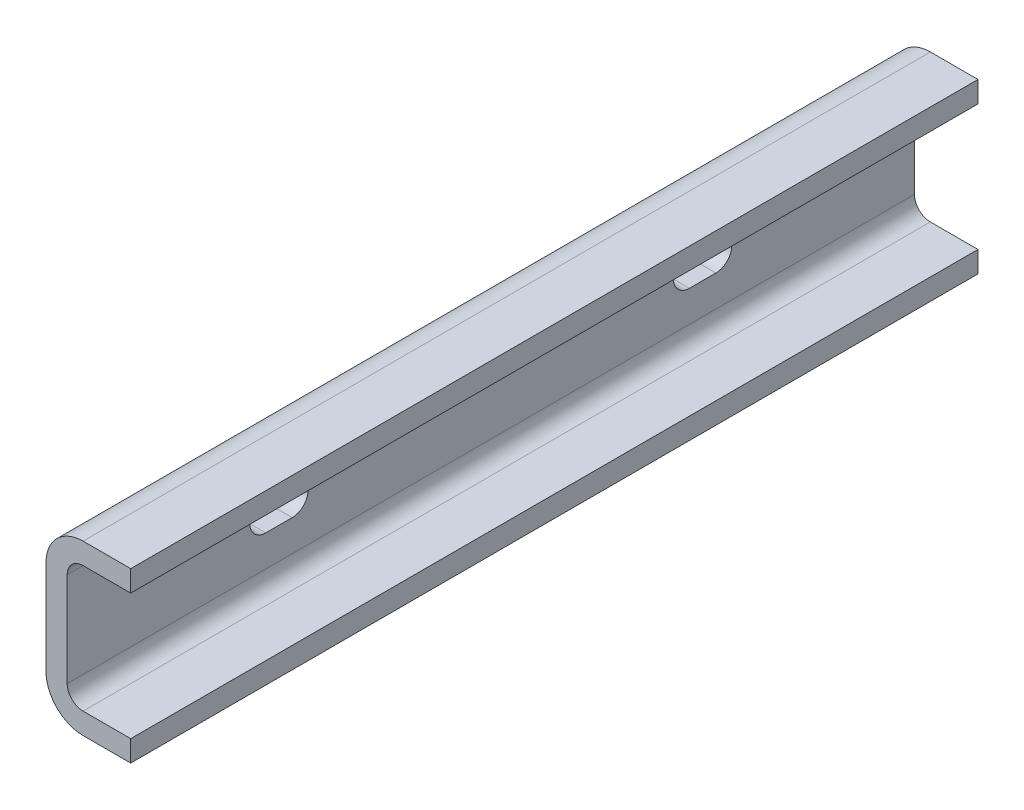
from build123d import *

# Parameters (mm, degrees)
EXTRUDE1_DEPTH  = 160
EXTRUDE2_DEPTH  = 162.235262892
LPATTERN1_COUNT = 2
LPATTERN1_PITCH = 80


with BuildPart() as part:
    # Sketch1 → Extrude1 (new body)
    with BuildSketch(Plane.XY):
        with BuildLine():
            Line((16, 11.9), (16, 15.9))
            Line((16, 15.9), (7, 15.9))
            ThreePointArc((7, 15.9), (2.050252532, 13.849747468), (0, 8.9))
            Line((0, 8.9), (0, -8.9))
            ThreePointArc((0, -8.9), (2.050252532, -13.849747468), (7, -15.9))
            Line((7, -15.9), (16, -15.9))
            Line((16, -15.9), (16, -11.9))
            Line((16, -11.9), (7, -11.9))
            ThreePointArc((7, -11.9), (4.878679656, -11.021320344), (4, -8.9))
            Line((4, -8.9), (4, 8.9))
            ThreePointArc((4, 8.9), (4.878679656, 11.021320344), (7, 11.9))
            Line((7, 11.9), (16, 11.9))
        make_face()
    extrude(amount=-EXTRUDE1_DEPTH)

    # Sketch2 → Extrude2 (cut, through all)
    with BuildSketch(Plane(origin=(4, 0, 0), x_dir=(0, 0, -1), z_dir=(1, 0, 0))):
        with BuildLine():
            Line((37.5, 3), (42.5, 3))
            ThreePointArc((42.5, 3), (45.5, 0), (42.5, -3))
            Line((42.5, -3), (37.5, -3))
            ThreePointArc((37.5, -3), (34.5, 0), (37.5, 3))
        make_face()
    extrude2 = extrude(amount=-EXTRUDE2_DEPTH, mode=Mode.SUBTRACT)

    # LPattern1: Extrude2 ×2
    with Locations(*[(0, 0, -i * LPATTERN1_PITCH) for i in range(1, LPATTERN1_COUNT)]):
        add(extrude2, mode=Mode.SUBTRACT)


solid = part.part
